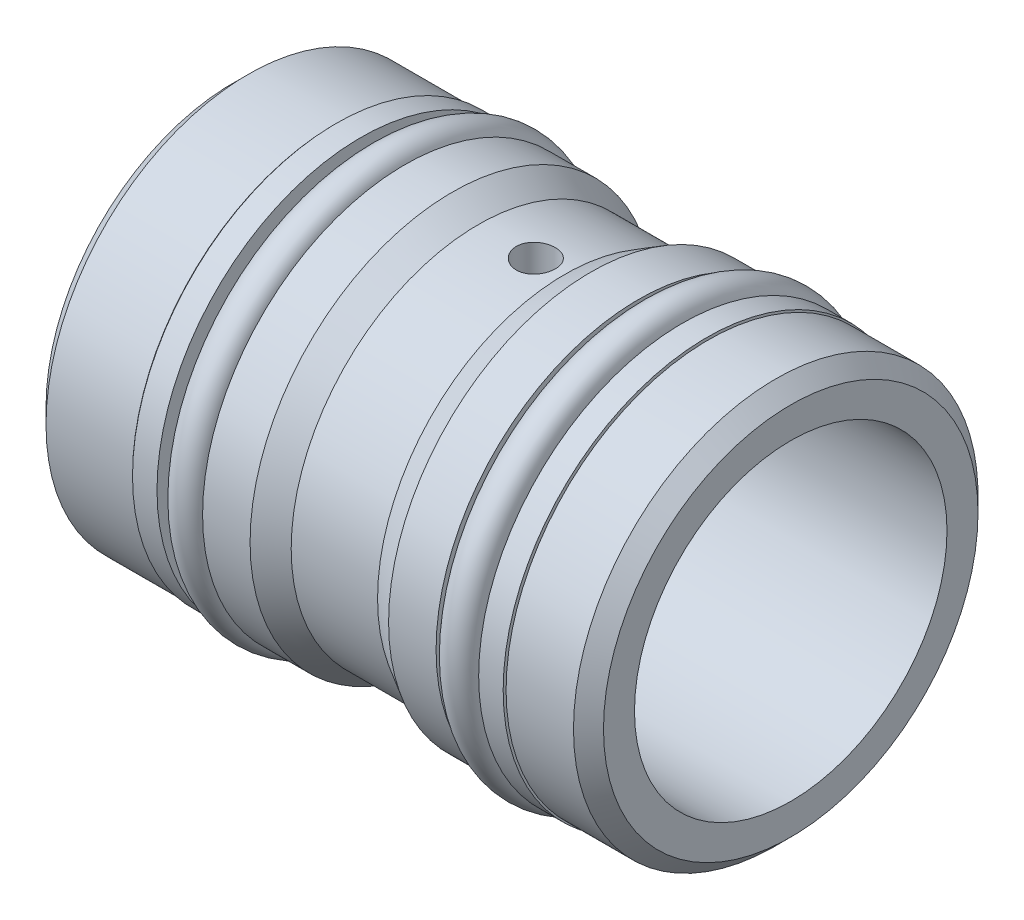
from build123d import *

# Parameters (mm, degrees)
FILLET1_R               = 0.381
CHAMFER1_SIZE           = 0.762
SKETCH6_R               = 0.889
SKETCH6_W               = 1.2446
SKETCH6_H               = 1.3462
CUT_EXTRUDE1_DEPTH      = 21.730334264
CUT_EXTRUDE1_DEPTH_BACK = 21.730334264
SKETCH7_R               = 0.9906


with BuildPart() as part:
    # Sketch1 → Revolve1 (revolve)
    with BuildSketch(Plane.XY, mode=Mode.PRIVATE) as revolve1_sk:
        Polygon((-14.16, 4.7625), (-14.16, 10.2743), (-9, 10.2743), (-9, 9.0043), (-5.444, 9.0043), (-5.444, 10.2743), (-3.031, 10.2743), (-3.031, 9.51), (4.0048, 9.51), (4.0048, 10.2743), (6.4178, 10.2743), (6.4178, 9.0043), (9.9738, 9.0043), (9.9738, 10.2743), (14.16, 10.2743), (14.16, 7.9375), (0.0884, 7.9375), (0.0884, 4.7625), align=None)
    revolve(revolve1_sk.sketch.rotate(Axis((0, 0, 0), (1, 0, 0)), 90), axis=Axis((0, 0, 0), (1, 0, 0)))

    # Fillet1
    fillet1_edges = [part.edges().sort_by_distance(p)[0] for p in [
        (-3.031, 0, -9.51),
        (4.0048, 0, -9.51),
    ]]
    fillet(fillet1_edges, radius=FILLET1_R)

    # Chamfer1
    chamfer1_edges = [part.edges().sort_by_distance(p)[0] for p in [
        (-14.16, 0, -10.2743),
        (14.16, 0, -10.2743),
    ]]
    chamfer(chamfer1_edges, length=CHAMFER1_SIZE)

    # Sketch6 → Revolve3 (revolve)
    with BuildSketch(Plane.XY, mode=Mode.PRIVATE) as revolve3_sk:
        with Locations((-6.4092, 9.8171)):
            Circle(SKETCH6_R)
        with Locations((7.383, 9.8171)):
            Circle(SKETCH6_R)
        with Locations((-8.3053, 9.6774)):
            Rectangle(SKETCH6_W, SKETCH6_H)
        with Locations((9.2791, 9.6774)):
            Rectangle(SKETCH6_W, SKETCH6_H)
    revolve(revolve3_sk.sketch.rotate(Axis((0, 0, 0), (1, 0, 0)), 90), axis=Axis((0, 0, 0), (1, 0, 0)))

    # Sketch7 → Cut-Extrude1 (cut, two sides: drawn at the far end of the back side and taken through both)
    with BuildSketch(Plane(origin=(0, 0, 0), x_dir=(0, 0, -1), z_dir=(0, 1, 0)).offset(-CUT_EXTRUDE1_DEPTH_BACK)):
        with Locations(Location((0, -1.21, 0), (0, 0, 180))):
            Circle(SKETCH7_R)
    extrude(amount=CUT_EXTRUDE1_DEPTH + CUT_EXTRUDE1_DEPTH_BACK, mode=Mode.SUBTRACT)

    # Sketch8 → Revolve4 (revolve)
    with BuildSketch(Plane.XY, mode=Mode.PRIVATE) as revolve4_sk:
        Polygon((-3.031, 10.2743), (-1.707193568, 9.51), (-3.031, 9.51), align=None)
        Polygon((4.0048, 10.2743), (2.680993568, 9.51), (4.0048, 9.51), align=None)
    revolve(revolve4_sk.sketch.rotate(Axis((0, 0, 0), (1, 0, 0)), 90), axis=Axis((0, 0, 0), (1, 0, 0)))


solid = part.part
